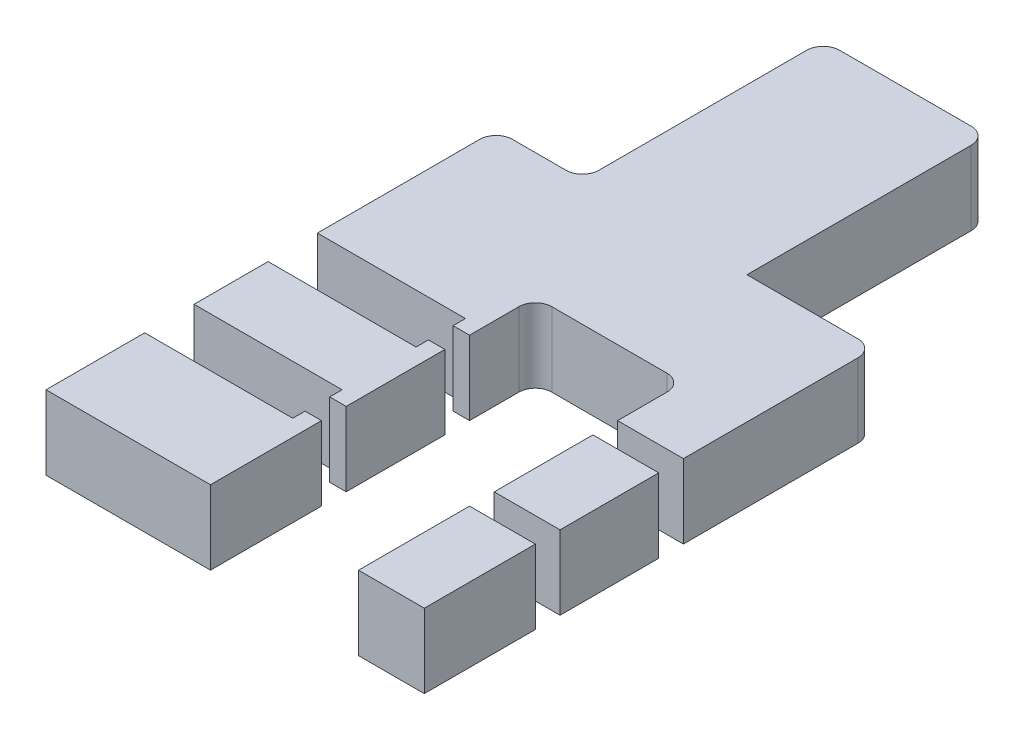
from build123d import *

# Parameters (mm, degrees)
BOSS_EXTRUDE1_DEPTH     = 9
FILLET3_R               = 2
CUT_EXTRUDE1_DEPTH      = 54.872534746
CUT_EXTRUDE1_DEPTH_BACK = 54.872534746
SKETCH2_W               = 77.12114438
SKETCH2_H               = 3
SKETCH2_W_2             = 82.978179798
SKETCH3_W               = 18
SKETCH3_H               = 6
CUT_EXTRUDE2_DEPTH      = 54.872534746


with BuildPart() as part:
    # Sketch1 → Boss-Extrude1 (new body)
    with BuildSketch(Plane(origin=(0, 0, 0), x_dir=(1, 0, 0), z_dir=(0, 1, 0))):
        Polygon((-9, 0), (-9, -39.5), (-29, -39.5), (-29, 15.227595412), (-18.5, 15.227595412), (-18.5, 44.5), (1.5, 44.5), (1.5, 15.227595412), (17, 15.227595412), (17, -39.5), (9, -39.5), (9, 0), align=None)
    extrude(amount=BOSS_EXTRUDE1_DEPTH)

    # Fillet3
    fillet3_edges = [part.edges().sort_by_distance(p)[0] for p in [
        (9, 4.5, 0),
        (-9, 4.5, 0),
        (-29, 4.5, -15.227595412),
        (-18.5, 4.5, -15.227595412),
        (-18.5, 4.5, -44.5),
        (1.5, 4.5, -44.5),
        (17, 4.5, -15.227595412),
    ]]
    fillet(fillet3_edges, radius=FILLET3_R)

    # Sketch2 → Cut-Extrude1 (cut, two sides: drawn at the far end of the back side and taken through both)
    with BuildSketch(Plane(origin=(0, 9, 0), x_dir=(1, 0, 0), z_dir=(0, 1, 0)).offset(-CUT_EXTRUDE1_DEPTH_BACK)):
        with Locations((-9, -9.5)):
            Rectangle(SKETCH2_W, SKETCH2_H)
        with Locations((-9, -24.5)):
            Rectangle(SKETCH2_W_2, SKETCH2_H)
    extrude(amount=CUT_EXTRUDE1_DEPTH + CUT_EXTRUDE1_DEPTH_BACK, mode=Mode.SUBTRACT)


with BuildPart() as cut_extrude1_piece_1:
    # of the separate pieces the step leaves, piece 1, a body of its own (cut_extrude1_pieces)
    add(part.part.solids().sort_by_distance((-9, 0, 2))[0])


with BuildPart() as cut_extrude1_piece_2:
    # of the separate pieces the step leaves, piece 2, a body of its own (cut_extrude1_pieces)
    add(part.part.solids().sort_by_distance((-9, 0, 26))[0])


with BuildPart() as cut_extrude1_piece_3:
    # of the separate pieces the step leaves, piece 3, a body of its own (cut_extrude1_pieces)
    add(part.part.solids().sort_by_distance((-9, 0, 11))[0])


with BuildPart() as cut_extrude1_piece_4:
    # of the separate pieces the step leaves, piece 4, a body of its own (cut_extrude1_pieces)
    add(part.part.solids().sort_by_distance((9, 0, 39.5))[0])


with BuildPart() as cut_extrude1_piece_5:
    # of the separate pieces the step leaves, piece 5, a body of its own (cut_extrude1_pieces)
    add(part.part.solids().sort_by_distance((9, 0, 23))[0])


with BuildPart() as cut_extrude2_tool:
    # Sketch3 → Cut-Extrude2 (new, through all)
    with BuildSketch(Plane(origin=(0, 9, 0), x_dir=(1, 0, 0), z_dir=(0, 1, 0))):
        with Locations((-20, -9.5)):
            Rectangle(SKETCH3_W, SKETCH3_H)
        with Locations((-20, -24.5)):
            Rectangle(SKETCH3_W, SKETCH3_H)
    extrude(amount=-CUT_EXTRUDE2_DEPTH)


with BuildPart() as cut_extrude1_piece_1_1:
    add(cut_extrude1_piece_1.part)

    # Cut-Extrude2: cut by cut_extrude2_tool
    add(cut_extrude2_tool.part, mode=Mode.SUBTRACT)


with BuildPart() as cut_extrude1_piece_2_1:
    add(cut_extrude1_piece_2.part)

    # Cut-Extrude2: cut by cut_extrude2_tool
    add(cut_extrude2_tool.part, mode=Mode.SUBTRACT)


with BuildPart() as cut_extrude1_piece_3_1:
    add(cut_extrude1_piece_3.part)

    # Cut-Extrude2: cut by cut_extrude2_tool
    add(cut_extrude2_tool.part, mode=Mode.SUBTRACT)


solid = Compound([cut_extrude1_piece_4.part, cut_extrude1_piece_5.part, cut_extrude1_piece_1_1.part, cut_extrude1_piece_2_1.part, cut_extrude1_piece_3_1.part])
